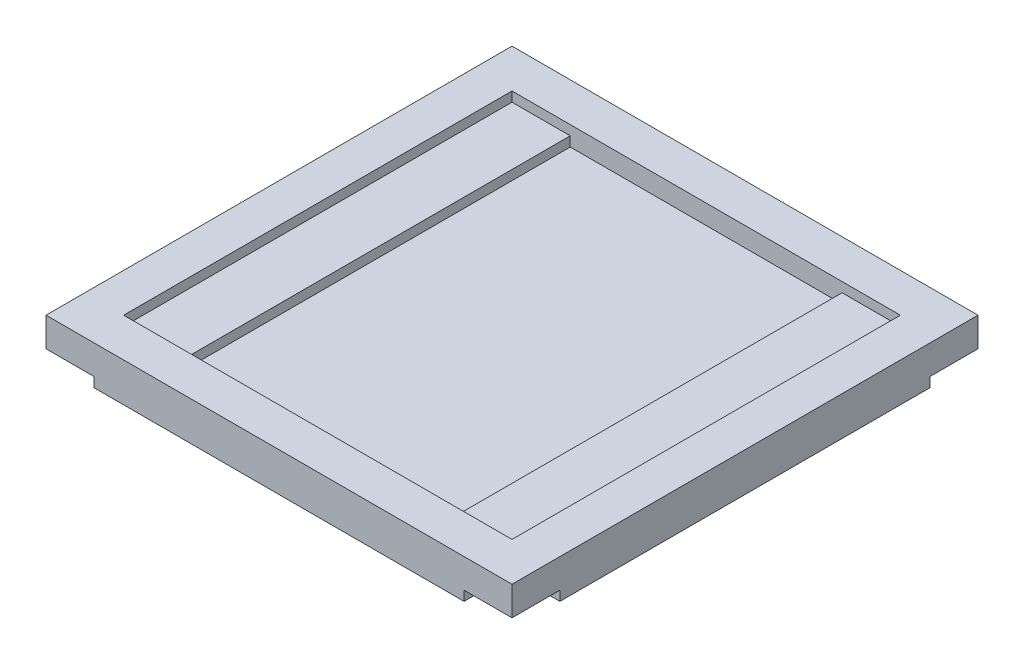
ISO-10303-21;
HEADER;
FILE_DESCRIPTION(('STEP AP214'),'2;1');
FILE_NAME('part.step','',(''),(''),'','','');
FILE_SCHEMA(('AUTOMOTIVE_DESIGN { 1 0 10303 214 1 1 1 1 }'));
ENDSEC;
DATA;
#1=APPLICATION_CONTEXT('core data for automotive mechanical design processes');
#2=APPLICATION_PROTOCOL_DEFINITION('international standard','automotive_design',2000,#1);
#3=PRODUCT_CONTEXT('',#1,'mechanical');
#4=PRODUCT('Part','Part','',(#3));
#5=PRODUCT_RELATED_PRODUCT_CATEGORY('part','',(#4));
#6=PRODUCT_DEFINITION_FORMATION('','',#4);
#7=PRODUCT_DEFINITION_CONTEXT('part definition',#1,'design');
#8=PRODUCT_DEFINITION('design','',#6,#7);
#9=PRODUCT_DEFINITION_SHAPE('','',#8);
#10=(LENGTH_UNIT() NAMED_UNIT(*) SI_UNIT(.MILLI.,.METRE.));
#11=(NAMED_UNIT(*) PLANE_ANGLE_UNIT() SI_UNIT($,.RADIAN.));
#12=(NAMED_UNIT(*) SI_UNIT($,.STERADIAN.) SOLID_ANGLE_UNIT());
#13=UNCERTAINTY_MEASURE_WITH_UNIT(LENGTH_MEASURE(1.E-05),#10,'distance_accuracy_value','');
#14=(GEOMETRIC_REPRESENTATION_CONTEXT(3) GLOBAL_UNCERTAINTY_ASSIGNED_CONTEXT((#13)) GLOBAL_UNIT_ASSIGNED_CONTEXT((#10,
#11,#12)) REPRESENTATION_CONTEXT('',''));
#15=CARTESIAN_POINT('',(0.,0.,0.));
#16=DIRECTION('',(0.,0.,1.));
#17=DIRECTION('',(1.,0.,0.));
#18=AXIS2_PLACEMENT_3D('',#15,#16,#17);
#19=CARTESIAN_POINT('',(0.,7.5,0.));
#20=DIRECTION('',(0.,1.,0.));
#21=DIRECTION('',(0.,0.,1.));
#22=AXIS2_PLACEMENT_3D('',#19,#20,#21);
#23=PLANE('',#22);
#24=DIRECTION('',(0.,0.,1.));
#25=VECTOR('',#24,1.);
#26=CARTESIAN_POINT('',(15.,7.5,-100.));
#27=LINE('',#26,#25);
#28=CARTESIAN_POINT('',(15.,7.5,-100.));
#29=VERTEX_POINT('',#28);
#30=CARTESIAN_POINT('',(15.,7.5,0.));
#31=VERTEX_POINT('',#30);
#32=EDGE_CURVE('E215',#29,#31,#27,.T.);
#33=ORIENTED_EDGE('',*,*,#32,.F.);
#34=DIRECTION('',(-1.,0.,0.));
#35=VECTOR('',#34,1.);
#36=CARTESIAN_POINT('',(0.,7.5,-100.));
#37=LINE('',#36,#35);
#38=CARTESIAN_POINT('',(0.,7.5,-100.));
#39=VERTEX_POINT('',#38);
#40=EDGE_CURVE('E267',#29,#39,#37,.T.);
#41=ORIENTED_EDGE('',*,*,#40,.T.);
#42=DIRECTION('',(0.,0.,1.));
#43=VECTOR('',#42,1.);
#44=CARTESIAN_POINT('',(0.,7.5,-100.));
#45=LINE('',#44,#43);
#46=CARTESIAN_POINT('',(0.,7.5,0.));
#47=VERTEX_POINT('',#46);
#48=EDGE_CURVE('E254',#39,#47,#45,.T.);
#49=ORIENTED_EDGE('',*,*,#48,.T.);
#50=DIRECTION('',(1.,0.,0.));
#51=VECTOR('',#50,1.);
#52=CARTESIAN_POINT('',(0.,7.5,0.));
#53=LINE('',#52,#51);
#54=EDGE_CURVE('E260',#47,#31,#53,.T.);
#55=ORIENTED_EDGE('',*,*,#54,.T.);
#56=EDGE_LOOP('',(#33,#41,#49,#55));
#57=FACE_BOUND('',#56,.T.);
#58=ADVANCED_FACE('F45',(#57),#23,.T.);
#59=CARTESIAN_POINT('',(-10.,10.,10.));
#60=DIRECTION('',(0.,0.,-1.));
#61=DIRECTION('',(-1.,0.,0.));
#62=AXIS2_PLACEMENT_3D('',#59,#60,#61);
#63=PLANE('',#62);
#64=DIRECTION('',(1.,0.,0.));
#65=VECTOR('',#64,1.);
#66=CARTESIAN_POINT('',(-10.,0.,10.));
#67=LINE('',#66,#65);
#68=CARTESIAN_POINT('',(2.34,0.,10.));
#69=VERTEX_POINT('',#68);
#70=CARTESIAN_POINT('',(97.66,0.,10.));
#71=VERTEX_POINT('',#70);
#72=EDGE_CURVE('E417',#69,#71,#67,.T.);
#73=ORIENTED_EDGE('',*,*,#72,.T.);
#74=DIRECTION('',(0.,-1.,0.));
#75=VECTOR('',#74,1.);
#76=CARTESIAN_POINT('',(97.66,2.5,10.));
#77=LINE('',#76,#75);
#78=CARTESIAN_POINT('',(97.66,2.5,10.));
#79=VERTEX_POINT('',#78);
#80=EDGE_CURVE('E306',#79,#71,#77,.T.);
#81=ORIENTED_EDGE('',*,*,#80,.F.);
#82=DIRECTION('',(-1.,0.,0.));
#83=VECTOR('',#82,1.);
#84=CARTESIAN_POINT('',(97.66,2.5,10.));
#85=LINE('',#84,#83);
#86=CARTESIAN_POINT('',(110.,2.5,10.));
#87=VERTEX_POINT('',#86);
#88=EDGE_CURVE('E301',#87,#79,#85,.T.);
#89=ORIENTED_EDGE('',*,*,#88,.F.);
#90=DIRECTION('',(0.,-1.,0.));
#91=VECTOR('',#90,1.);
#92=CARTESIAN_POINT('',(110.,10.,10.));
#93=LINE('',#92,#91);
#94=CARTESIAN_POINT('',(110.,10.,10.));
#95=VERTEX_POINT('',#94);
#96=EDGE_CURVE('E11',#95,#87,#93,.T.);
#97=ORIENTED_EDGE('',*,*,#96,.F.);
#98=DIRECTION('',(1.,0.,0.));
#99=VECTOR('',#98,1.);
#100=CARTESIAN_POINT('',(-10.,10.,10.));
#101=LINE('',#100,#99);
#102=CARTESIAN_POINT('',(-10.,10.,10.));
#103=VERTEX_POINT('',#102);
#104=EDGE_CURVE('E423',#103,#95,#101,.T.);
#105=ORIENTED_EDGE('',*,*,#104,.F.);
#106=DIRECTION('',(0.,-1.,0.));
#107=VECTOR('',#106,1.);
#108=CARTESIAN_POINT('',(-10.,10.,10.));
#109=LINE('',#108,#107);
#110=CARTESIAN_POINT('',(-10.,2.5,10.));
#111=VERTEX_POINT('',#110);
#112=EDGE_CURVE('E437',#103,#111,#109,.T.);
#113=ORIENTED_EDGE('',*,*,#112,.T.);
#114=DIRECTION('',(-1.,0.,0.));
#115=VECTOR('',#114,1.);
#116=CARTESIAN_POINT('',(-10.,2.5,10.));
#117=LINE('',#116,#115);
#118=CARTESIAN_POINT('',(2.34,2.5,10.));
#119=VERTEX_POINT('',#118);
#120=EDGE_CURVE('E404',#119,#111,#117,.T.);
#121=ORIENTED_EDGE('',*,*,#120,.F.);
#122=DIRECTION('',(0.,-1.,0.));
#123=VECTOR('',#122,1.);
#124=CARTESIAN_POINT('',(2.34,2.5,10.));
#125=LINE('',#124,#123);
#126=EDGE_CURVE('E413',#119,#69,#125,.T.);
#127=ORIENTED_EDGE('',*,*,#126,.T.);
#128=EDGE_LOOP('',(#73,#81,#89,#97,#105,#113,#121,#127));
#129=FACE_BOUND('',#128,.T.);
#130=ADVANCED_FACE('F47',(#129),#63,.F.);
#131=CARTESIAN_POINT('',(110.,10.,10.));
#132=DIRECTION('',(-1.,0.,0.));
#133=DIRECTION('',(0.,0.,1.));
#134=AXIS2_PLACEMENT_3D('',#131,#132,#133);
#135=PLANE('',#134);
#136=DIRECTION('',(0.,0.,-1.));
#137=VECTOR('',#136,1.);
#138=CARTESIAN_POINT('',(110.,0.,10.));
#139=LINE('',#138,#137);
#140=CARTESIAN_POINT('',(110.,0.,-2.34));
#141=VERTEX_POINT('',#140);
#142=CARTESIAN_POINT('',(110.,0.,-97.66));
#143=VERTEX_POINT('',#142);
#144=EDGE_CURVE('E441',#141,#143,#139,.T.);
#145=ORIENTED_EDGE('',*,*,#144,.T.);
#146=DIRECTION('',(0.,-1.,0.));
#147=VECTOR('',#146,1.);
#148=CARTESIAN_POINT('',(110.,2.5,-97.66));
#149=LINE('',#148,#147);
#150=CARTESIAN_POINT('',(110.,2.5,-97.66));
#151=VERTEX_POINT('',#150);
#152=EDGE_CURVE('E336',#151,#143,#149,.T.);
#153=ORIENTED_EDGE('',*,*,#152,.F.);
#154=DIRECTION('',(0.,0.,1.));
#155=VECTOR('',#154,1.);
#156=CARTESIAN_POINT('',(110.,2.5,-97.66));
#157=LINE('',#156,#155);
#158=CARTESIAN_POINT('',(110.,2.5,-110.));
#159=VERTEX_POINT('',#158);
#160=EDGE_CURVE('E353',#159,#151,#157,.T.);
#161=ORIENTED_EDGE('',*,*,#160,.F.);
#162=DIRECTION('',(0.,-1.,0.));
#163=VECTOR('',#162,1.);
#164=CARTESIAN_POINT('',(110.,10.,-110.));
#165=LINE('',#164,#163);
#166=CARTESIAN_POINT('',(110.,10.,-110.));
#167=VERTEX_POINT('',#166);
#168=EDGE_CURVE('E54',#167,#159,#165,.T.);
#169=ORIENTED_EDGE('',*,*,#168,.F.);
#170=DIRECTION('',(0.,0.,-1.));
#171=VECTOR('',#170,1.);
#172=CARTESIAN_POINT('',(110.,10.,10.));
#173=LINE('',#172,#171);
#174=EDGE_CURVE('E427',#95,#167,#173,.T.);
#175=ORIENTED_EDGE('',*,*,#174,.F.);
#176=ORIENTED_EDGE('',*,*,#96,.T.);
#177=DIRECTION('',(0.,0.,1.));
#178=VECTOR('',#177,1.);
#179=CARTESIAN_POINT('',(110.,2.5,10.));
#180=LINE('',#179,#178);
#181=CARTESIAN_POINT('',(110.,2.5,-2.34));
#182=VERTEX_POINT('',#181);
#183=EDGE_CURVE('E321',#182,#87,#180,.T.);
#184=ORIENTED_EDGE('',*,*,#183,.F.);
#185=DIRECTION('',(0.,-1.,0.));
#186=VECTOR('',#185,1.);
#187=CARTESIAN_POINT('',(110.,2.5,-2.34));
#188=LINE('',#187,#186);
#189=EDGE_CURVE('E302',#182,#141,#188,.T.);
#190=ORIENTED_EDGE('',*,*,#189,.T.);
#191=EDGE_LOOP('',(#145,#153,#161,#169,#175,#176,#184,#190));
#192=FACE_BOUND('',#191,.T.);
#193=ADVANCED_FACE('F468',(#192),#135,.F.);
#194=CARTESIAN_POINT('',(-10.,10.,-110.));
#195=DIRECTION('',(0.,0.,1.));
#196=DIRECTION('',(1.,0.,0.));
#197=AXIS2_PLACEMENT_3D('',#194,#195,#196);
#198=PLANE('',#197);
#199=DIRECTION('',(-1.,0.,0.));
#200=VECTOR('',#199,1.);
#201=CARTESIAN_POINT('',(-10.,0.,-110.));
#202=LINE('',#201,#200);
#203=CARTESIAN_POINT('',(97.66,0.,-110.));
#204=VERTEX_POINT('',#203);
#205=CARTESIAN_POINT('',(2.33999999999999,0.,-110.));
#206=VERTEX_POINT('',#205);
#207=EDGE_CURVE('E445',#204,#206,#202,.T.);
#208=ORIENTED_EDGE('',*,*,#207,.T.);
#209=DIRECTION('',(0.,-1.,0.));
#210=VECTOR('',#209,1.);
#211=CARTESIAN_POINT('',(2.33999999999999,2.5,-110.));
#212=LINE('',#211,#210);
#213=CARTESIAN_POINT('',(2.33999999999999,2.5,-110.));
#214=VERTEX_POINT('',#213);
#215=EDGE_CURVE('E367',#214,#206,#212,.T.);
#216=ORIENTED_EDGE('',*,*,#215,.F.);
#217=DIRECTION('',(1.,0.,0.));
#218=VECTOR('',#217,1.);
#219=CARTESIAN_POINT('',(-9.99999999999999,2.5,-110.));
#220=LINE('',#219,#218);
#221=CARTESIAN_POINT('',(-9.99999999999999,2.5,-110.));
#222=VERTEX_POINT('',#221);
#223=EDGE_CURVE('E382',#222,#214,#220,.T.);
#224=ORIENTED_EDGE('',*,*,#223,.F.);
#225=DIRECTION('',(0.,-1.,0.));
#226=VECTOR('',#225,1.);
#227=CARTESIAN_POINT('',(-10.,10.,-110.));
#228=LINE('',#227,#226);
#229=CARTESIAN_POINT('',(-10.,10.,-110.));
#230=VERTEX_POINT('',#229);
#231=EDGE_CURVE('E455',#230,#222,#228,.T.);
#232=ORIENTED_EDGE('',*,*,#231,.F.);
#233=DIRECTION('',(-1.,0.,0.));
#234=VECTOR('',#233,1.);
#235=CARTESIAN_POINT('',(-10.,10.,-110.));
#236=LINE('',#235,#234);
#237=EDGE_CURVE('E431',#167,#230,#236,.T.);
#238=ORIENTED_EDGE('',*,*,#237,.F.);
#239=ORIENTED_EDGE('',*,*,#168,.T.);
#240=DIRECTION('',(1.,0.,0.));
#241=VECTOR('',#240,1.);
#242=CARTESIAN_POINT('',(97.66,2.5,-110.));
#243=LINE('',#242,#241);
#244=CARTESIAN_POINT('',(97.66,2.5,-110.));
#245=VERTEX_POINT('',#244);
#246=EDGE_CURVE('E356',#245,#159,#243,.T.);
#247=ORIENTED_EDGE('',*,*,#246,.F.);
#248=DIRECTION('',(0.,-1.,0.));
#249=VECTOR('',#248,1.);
#250=CARTESIAN_POINT('',(97.66,2.5,-110.));
#251=LINE('',#250,#249);
#252=EDGE_CURVE('E331',#245,#204,#251,.T.);
#253=ORIENTED_EDGE('',*,*,#252,.T.);
#254=EDGE_LOOP('',(#208,#216,#224,#232,#238,#239,#247,#253));
#255=FACE_BOUND('',#254,.T.);
#256=ADVANCED_FACE('F464',(#255),#198,.F.);
#257=CARTESIAN_POINT('',(-10.,10.,10.));
#258=DIRECTION('',(1.,0.,0.));
#259=DIRECTION('',(0.,0.,-1.));
#260=AXIS2_PLACEMENT_3D('',#257,#258,#259);
#261=PLANE('',#260);
#262=DIRECTION('',(0.,0.,-1.));
#263=VECTOR('',#262,1.);
#264=CARTESIAN_POINT('',(-9.99999999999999,2.5,-97.66));
#265=LINE('',#264,#263);
#266=CARTESIAN_POINT('',(-9.99999999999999,2.5,-97.66));
#267=VERTEX_POINT('',#266);
#268=EDGE_CURVE('E385',#267,#222,#265,.T.);
#269=ORIENTED_EDGE('',*,*,#268,.F.);
#270=DIRECTION('',(0.,-1.,0.));
#271=VECTOR('',#270,1.);
#272=CARTESIAN_POINT('',(-9.99999999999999,2.5,-97.66));
#273=LINE('',#272,#271);
#274=CARTESIAN_POINT('',(-9.99999999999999,0.,-97.66));
#275=VERTEX_POINT('',#274);
#276=EDGE_CURVE('E362',#267,#275,#273,.T.);
#277=ORIENTED_EDGE('',*,*,#276,.T.);
#278=DIRECTION('',(0.,0.,1.));
#279=VECTOR('',#278,1.);
#280=CARTESIAN_POINT('',(-10.,0.,10.));
#281=LINE('',#280,#279);
#282=CARTESIAN_POINT('',(-10.,0.,-2.34));
#283=VERTEX_POINT('',#282);
#284=EDGE_CURVE('E428',#275,#283,#281,.T.);
#285=ORIENTED_EDGE('',*,*,#284,.T.);
#286=DIRECTION('',(0.,-1.,0.));
#287=VECTOR('',#286,1.);
#288=CARTESIAN_POINT('',(-10.,2.5,-2.34));
#289=LINE('',#288,#287);
#290=CARTESIAN_POINT('',(-10.,2.5,-2.34));
#291=VERTEX_POINT('',#290);
#292=EDGE_CURVE('E407',#291,#283,#289,.T.);
#293=ORIENTED_EDGE('',*,*,#292,.F.);
#294=DIRECTION('',(0.,0.,-1.));
#295=VECTOR('',#294,1.);
#296=CARTESIAN_POINT('',(-10.,2.5,10.));
#297=LINE('',#296,#295);
#298=EDGE_CURVE('E391',#111,#291,#297,.T.);
#299=ORIENTED_EDGE('',*,*,#298,.F.);
#300=ORIENTED_EDGE('',*,*,#112,.F.);
#301=DIRECTION('',(0.,0.,1.));
#302=VECTOR('',#301,1.);
#303=CARTESIAN_POINT('',(-10.,10.,10.));
#304=LINE('',#303,#302);
#305=EDGE_CURVE('E434',#230,#103,#304,.T.);
#306=ORIENTED_EDGE('',*,*,#305,.F.);
#307=ORIENTED_EDGE('',*,*,#231,.T.);
#308=EDGE_LOOP('',(#269,#277,#285,#293,#299,#300,#306,#307));
#309=FACE_BOUND('',#308,.T.);
#310=ADVANCED_FACE('F496',(#309),#261,.F.);
#311=CARTESIAN_POINT('',(0.,10.,0.));
#312=DIRECTION('',(0.,1.,0.));
#313=DIRECTION('',(0.,0.,1.));
#314=AXIS2_PLACEMENT_3D('',#311,#312,#313);
#315=PLANE('',#314);
#316=DIRECTION('',(0.,0.,1.));
#317=VECTOR('',#316,1.);
#318=CARTESIAN_POINT('',(0.,10.,-100.));
#319=LINE('',#318,#317);
#320=CARTESIAN_POINT('',(0.,10.,-100.));
#321=VERTEX_POINT('',#320);
#322=CARTESIAN_POINT('',(0.,10.,0.));
#323=VERTEX_POINT('',#322);
#324=EDGE_CURVE('E69',#321,#323,#319,.T.);
#325=ORIENTED_EDGE('',*,*,#324,.F.);
#326=DIRECTION('',(-1.,0.,0.));
#327=VECTOR('',#326,1.);
#328=CARTESIAN_POINT('',(0.,10.,-100.));
#329=LINE('',#328,#327);
#330=CARTESIAN_POINT('',(100.,10.,-100.));
#331=VERTEX_POINT('',#330);
#332=EDGE_CURVE('E259',#331,#321,#329,.T.);
#333=ORIENTED_EDGE('',*,*,#332,.F.);
#334=DIRECTION('',(0.,0.,-1.));
#335=VECTOR('',#334,1.);
#336=CARTESIAN_POINT('',(100.,10.,-100.));
#337=LINE('',#336,#335);
#338=CARTESIAN_POINT('',(100.,10.,0.));
#339=VERTEX_POINT('',#338);
#340=EDGE_CURVE('E278',#339,#331,#337,.T.);
#341=ORIENTED_EDGE('',*,*,#340,.F.);
#342=DIRECTION('',(1.,0.,0.));
#343=VECTOR('',#342,1.);
#344=CARTESIAN_POINT('',(0.,10.,0.));
#345=LINE('',#344,#343);
#346=EDGE_CURVE('E275',#323,#339,#345,.T.);
#347=ORIENTED_EDGE('',*,*,#346,.F.);
#348=EDGE_LOOP('',(#325,#333,#341,#347));
#349=FACE_BOUND('',#348,.T.);
#350=ORIENTED_EDGE('',*,*,#104,.T.);
#351=ORIENTED_EDGE('',*,*,#174,.T.);
#352=ORIENTED_EDGE('',*,*,#237,.T.);
#353=ORIENTED_EDGE('',*,*,#305,.T.);
#354=EDGE_LOOP('',(#350,#351,#352,#353));
#355=FACE_BOUND('',#354,.T.);
#356=ADVANCED_FACE('F501',(#349,#355),#315,.T.);
#357=CARTESIAN_POINT('',(0.,0.,0.));
#358=DIRECTION('',(0.,1.,0.));
#359=DIRECTION('',(0.,0.,1.));
#360=AXIS2_PLACEMENT_3D('',#357,#358,#359);
#361=PLANE('',#360);
#362=ORIENTED_EDGE('',*,*,#284,.F.);
#363=DIRECTION('',(-1.,0.,0.));
#364=VECTOR('',#363,1.);
#365=CARTESIAN_POINT('',(-9.99999999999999,0.,-97.66));
#366=LINE('',#365,#364);
#367=CARTESIAN_POINT('',(2.33999999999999,0.,-97.66));
#368=VERTEX_POINT('',#367);
#369=EDGE_CURVE('E342',#368,#275,#366,.T.);
#370=ORIENTED_EDGE('',*,*,#369,.F.);
#371=DIRECTION('',(0.,0.,1.));
#372=VECTOR('',#371,1.);
#373=CARTESIAN_POINT('',(2.33999999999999,0.,-97.66));
#374=LINE('',#373,#372);
#375=EDGE_CURVE('E372',#206,#368,#374,.T.);
#376=ORIENTED_EDGE('',*,*,#375,.F.);
#377=ORIENTED_EDGE('',*,*,#207,.F.);
#378=DIRECTION('',(0.,0.,-1.));
#379=VECTOR('',#378,1.);
#380=CARTESIAN_POINT('',(97.66,0.,-97.66));
#381=LINE('',#380,#379);
#382=CARTESIAN_POINT('',(97.66,0.,-97.66));
#383=VERTEX_POINT('',#382);
#384=EDGE_CURVE('E309',#383,#204,#381,.T.);
#385=ORIENTED_EDGE('',*,*,#384,.F.);
#386=DIRECTION('',(-1.,0.,0.));
#387=VECTOR('',#386,1.);
#388=CARTESIAN_POINT('',(97.66,0.,-97.66));
#389=LINE('',#388,#387);
#390=EDGE_CURVE('E343',#143,#383,#389,.T.);
#391=ORIENTED_EDGE('',*,*,#390,.F.);
#392=ORIENTED_EDGE('',*,*,#144,.F.);
#393=DIRECTION('',(1.,0.,0.));
#394=VECTOR('',#393,1.);
#395=CARTESIAN_POINT('',(97.66,0.,-2.34));
#396=LINE('',#395,#394);
#397=CARTESIAN_POINT('',(97.66,0.,-2.34));
#398=VERTEX_POINT('',#397);
#399=EDGE_CURVE('E310',#398,#141,#396,.T.);
#400=ORIENTED_EDGE('',*,*,#399,.F.);
#401=DIRECTION('',(0.,0.,-1.));
#402=VECTOR('',#401,1.);
#403=CARTESIAN_POINT('',(97.66,0.,10.));
#404=LINE('',#403,#402);
#405=EDGE_CURVE('E313',#71,#398,#404,.T.);
#406=ORIENTED_EDGE('',*,*,#405,.F.);
#407=ORIENTED_EDGE('',*,*,#72,.F.);
#408=DIRECTION('',(0.,0.,1.));
#409=VECTOR('',#408,1.);
#410=CARTESIAN_POINT('',(2.34,0.,10.));
#411=LINE('',#410,#409);
#412=CARTESIAN_POINT('',(2.34,0.,-2.34));
#413=VERTEX_POINT('',#412);
#414=EDGE_CURVE('E396',#413,#69,#411,.T.);
#415=ORIENTED_EDGE('',*,*,#414,.F.);
#416=DIRECTION('',(1.,0.,0.));
#417=VECTOR('',#416,1.);
#418=CARTESIAN_POINT('',(-10.,0.,-2.34));
#419=LINE('',#418,#417);
#420=EDGE_CURVE('E317',#283,#413,#419,.T.);
#421=ORIENTED_EDGE('',*,*,#420,.F.);
#422=EDGE_LOOP('',(#362,#370,#376,#377,#385,#391,#392,#400,#406,#407,#415,#421));
#423=FACE_BOUND('',#422,.T.);
#424=ADVANCED_FACE('F485',(#423),#361,.F.);
#425=CARTESIAN_POINT('',(2.34,2.5,10.));
#426=DIRECTION('',(1.,0.,0.));
#427=DIRECTION('',(0.,0.,-1.));
#428=AXIS2_PLACEMENT_3D('',#425,#426,#427);
#429=PLANE('',#428);
#430=ORIENTED_EDGE('',*,*,#414,.T.);
#431=ORIENTED_EDGE('',*,*,#126,.F.);
#432=DIRECTION('',(0.,0.,1.));
#433=VECTOR('',#432,1.);
#434=CARTESIAN_POINT('',(2.34,2.5,10.));
#435=LINE('',#434,#433);
#436=CARTESIAN_POINT('',(2.34,2.5,-2.34));
#437=VERTEX_POINT('',#436);
#438=EDGE_CURVE('E400',#437,#119,#435,.T.);
#439=ORIENTED_EDGE('',*,*,#438,.F.);
#440=DIRECTION('',(0.,-1.,0.));
#441=VECTOR('',#440,1.);
#442=CARTESIAN_POINT('',(2.34,2.5,-2.34));
#443=LINE('',#442,#441);
#444=EDGE_CURVE('E418',#437,#413,#443,.T.);
#445=ORIENTED_EDGE('',*,*,#444,.T.);
#446=EDGE_LOOP('',(#430,#431,#439,#445));
#447=FACE_BOUND('',#446,.T.);
#448=ADVANCED_FACE('F521',(#447),#429,.F.);
#449=CARTESIAN_POINT('',(-10.,2.5,-2.34));
#450=DIRECTION('',(0.,0.,-1.));
#451=DIRECTION('',(-1.,0.,0.));
#452=AXIS2_PLACEMENT_3D('',#449,#450,#451);
#453=PLANE('',#452);
#454=ORIENTED_EDGE('',*,*,#420,.T.);
#455=ORIENTED_EDGE('',*,*,#444,.F.);
#456=DIRECTION('',(1.,0.,0.));
#457=VECTOR('',#456,1.);
#458=CARTESIAN_POINT('',(-10.,2.5,-2.34));
#459=LINE('',#458,#457);
#460=EDGE_CURVE('E395',#291,#437,#459,.T.);
#461=ORIENTED_EDGE('',*,*,#460,.F.);
#462=ORIENTED_EDGE('',*,*,#292,.T.);
#463=EDGE_LOOP('',(#454,#455,#461,#462));
#464=FACE_BOUND('',#463,.T.);
#465=ADVANCED_FACE('F526',(#464),#453,.F.);
#466=CARTESIAN_POINT('',(0.,2.5,0.));
#467=DIRECTION('',(0.,-1.,0.));
#468=DIRECTION('',(0.,0.,-1.));
#469=AXIS2_PLACEMENT_3D('',#466,#467,#468);
#470=PLANE('',#469);
#471=ORIENTED_EDGE('',*,*,#298,.T.);
#472=ORIENTED_EDGE('',*,*,#460,.T.);
#473=ORIENTED_EDGE('',*,*,#438,.T.);
#474=ORIENTED_EDGE('',*,*,#120,.T.);
#475=EDGE_LOOP('',(#471,#472,#473,#474));
#476=FACE_BOUND('',#475,.T.);
#477=ADVANCED_FACE('F523',(#476),#470,.T.);
#478=CARTESIAN_POINT('',(97.66,2.5,10.));
#479=DIRECTION('',(-1.,0.,0.));
#480=DIRECTION('',(0.,0.,1.));
#481=AXIS2_PLACEMENT_3D('',#478,#479,#480);
#482=PLANE('',#481);
#483=ORIENTED_EDGE('',*,*,#405,.T.);
#484=DIRECTION('',(0.,-1.,0.));
#485=VECTOR('',#484,1.);
#486=CARTESIAN_POINT('',(97.66,2.5,-2.34));
#487=LINE('',#486,#485);
#488=CARTESIAN_POINT('',(97.66,2.5,-2.34));
#489=VERTEX_POINT('',#488);
#490=EDGE_CURVE('E297',#489,#398,#487,.T.);
#491=ORIENTED_EDGE('',*,*,#490,.F.);
#492=DIRECTION('',(0.,0.,-1.));
#493=VECTOR('',#492,1.);
#494=CARTESIAN_POINT('',(97.66,2.5,10.));
#495=LINE('',#494,#493);
#496=EDGE_CURVE('E314',#79,#489,#495,.T.);
#497=ORIENTED_EDGE('',*,*,#496,.F.);
#498=ORIENTED_EDGE('',*,*,#80,.T.);
#499=EDGE_LOOP('',(#483,#491,#497,#498));
#500=FACE_BOUND('',#499,.T.);
#501=ADVANCED_FACE('F685',(#500),#482,.F.);
#502=CARTESIAN_POINT('',(97.66,2.5,-2.34));
#503=DIRECTION('',(0.,0.,-1.));
#504=DIRECTION('',(-1.,0.,0.));
#505=AXIS2_PLACEMENT_3D('',#502,#503,#504);
#506=PLANE('',#505);
#507=ORIENTED_EDGE('',*,*,#399,.T.);
#508=ORIENTED_EDGE('',*,*,#189,.F.);
#509=DIRECTION('',(1.,0.,0.));
#510=VECTOR('',#509,1.);
#511=CARTESIAN_POINT('',(97.66,2.5,-2.34));
#512=LINE('',#511,#510);
#513=EDGE_CURVE('E324',#489,#182,#512,.T.);
#514=ORIENTED_EDGE('',*,*,#513,.F.);
#515=ORIENTED_EDGE('',*,*,#490,.T.);
#516=EDGE_LOOP('',(#507,#508,#514,#515));
#517=FACE_BOUND('',#516,.T.);
#518=ADVANCED_FACE('F512',(#517),#506,.F.);
#519=CARTESIAN_POINT('',(0.,2.5,0.));
#520=DIRECTION('',(0.,-1.,0.));
#521=DIRECTION('',(0.,0.,-1.));
#522=AXIS2_PLACEMENT_3D('',#519,#520,#521);
#523=PLANE('',#522);
#524=ORIENTED_EDGE('',*,*,#496,.T.);
#525=ORIENTED_EDGE('',*,*,#513,.T.);
#526=ORIENTED_EDGE('',*,*,#183,.T.);
#527=ORIENTED_EDGE('',*,*,#88,.T.);
#528=EDGE_LOOP('',(#524,#525,#526,#527));
#529=FACE_BOUND('',#528,.T.);
#530=ADVANCED_FACE('F509',(#529),#523,.T.);
#531=CARTESIAN_POINT('',(97.66,2.5,-97.66));
#532=DIRECTION('',(-1.,0.,0.));
#533=DIRECTION('',(0.,0.,1.));
#534=AXIS2_PLACEMENT_3D('',#531,#532,#533);
#535=PLANE('',#534);
#536=ORIENTED_EDGE('',*,*,#384,.T.);
#537=ORIENTED_EDGE('',*,*,#252,.F.);
#538=DIRECTION('',(0.,0.,-1.));
#539=VECTOR('',#538,1.);
#540=CARTESIAN_POINT('',(97.66,2.5,-97.66));
#541=LINE('',#540,#539);
#542=CARTESIAN_POINT('',(97.66,2.5,-97.66));
#543=VERTEX_POINT('',#542);
#544=EDGE_CURVE('E347',#543,#245,#541,.T.);
#545=ORIENTED_EDGE('',*,*,#544,.F.);
#546=DIRECTION('',(0.,-1.,0.));
#547=VECTOR('',#546,1.);
#548=CARTESIAN_POINT('',(97.66,2.5,-97.66));
#549=LINE('',#548,#547);
#550=EDGE_CURVE('E339',#543,#383,#549,.T.);
#551=ORIENTED_EDGE('',*,*,#550,.T.);
#552=EDGE_LOOP('',(#536,#537,#545,#551));
#553=FACE_BOUND('',#552,.T.);
#554=ADVANCED_FACE('F479',(#553),#535,.F.);
#555=CARTESIAN_POINT('',(97.66,2.5,-97.66));
#556=DIRECTION('',(0.,0.,1.));
#557=DIRECTION('',(1.,0.,0.));
#558=AXIS2_PLACEMENT_3D('',#555,#556,#557);
#559=PLANE('',#558);
#560=ORIENTED_EDGE('',*,*,#390,.T.);
#561=ORIENTED_EDGE('',*,*,#550,.F.);
#562=DIRECTION('',(-1.,0.,0.));
#563=VECTOR('',#562,1.);
#564=CARTESIAN_POINT('',(97.66,2.5,-97.66));
#565=LINE('',#564,#563);
#566=EDGE_CURVE('E335',#151,#543,#565,.T.);
#567=ORIENTED_EDGE('',*,*,#566,.F.);
#568=ORIENTED_EDGE('',*,*,#152,.T.);
#569=EDGE_LOOP('',(#560,#561,#567,#568));
#570=FACE_BOUND('',#569,.T.);
#571=ADVANCED_FACE('F474',(#570),#559,.F.);
#572=CARTESIAN_POINT('',(0.,2.5,0.));
#573=DIRECTION('',(0.,-1.,0.));
#574=DIRECTION('',(0.,0.,-1.));
#575=AXIS2_PLACEMENT_3D('',#572,#573,#574);
#576=PLANE('',#575);
#577=ORIENTED_EDGE('',*,*,#544,.T.);
#578=ORIENTED_EDGE('',*,*,#246,.T.);
#579=ORIENTED_EDGE('',*,*,#160,.T.);
#580=ORIENTED_EDGE('',*,*,#566,.T.);
#581=EDGE_LOOP('',(#577,#578,#579,#580));
#582=FACE_BOUND('',#581,.T.);
#583=ADVANCED_FACE('F472',(#582),#576,.T.);
#584=CARTESIAN_POINT('',(-9.99999999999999,2.5,-97.66));
#585=DIRECTION('',(0.,0.,1.));
#586=DIRECTION('',(1.,0.,0.));
#587=AXIS2_PLACEMENT_3D('',#584,#585,#586);
#588=PLANE('',#587);
#589=ORIENTED_EDGE('',*,*,#369,.T.);
#590=ORIENTED_EDGE('',*,*,#276,.F.);
#591=DIRECTION('',(-1.,0.,0.));
#592=VECTOR('',#591,1.);
#593=CARTESIAN_POINT('',(-9.99999999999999,2.5,-97.66));
#594=LINE('',#593,#592);
#595=CARTESIAN_POINT('',(2.33999999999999,2.5,-97.66));
#596=VERTEX_POINT('',#595);
#597=EDGE_CURVE('E376',#596,#267,#594,.T.);
#598=ORIENTED_EDGE('',*,*,#597,.F.);
#599=DIRECTION('',(0.,-1.,0.));
#600=VECTOR('',#599,1.);
#601=CARTESIAN_POINT('',(2.33999999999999,2.5,-97.66));
#602=LINE('',#601,#600);
#603=EDGE_CURVE('E288',#596,#368,#602,.T.);
#604=ORIENTED_EDGE('',*,*,#603,.T.);
#605=EDGE_LOOP('',(#589,#590,#598,#604));
#606=FACE_BOUND('',#605,.T.);
#607=ADVANCED_FACE('F529',(#606),#588,.F.);
#608=CARTESIAN_POINT('',(2.33999999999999,2.5,-97.66));
#609=DIRECTION('',(1.,0.,0.));
#610=DIRECTION('',(0.,0.,-1.));
#611=AXIS2_PLACEMENT_3D('',#608,#609,#610);
#612=PLANE('',#611);
#613=ORIENTED_EDGE('',*,*,#375,.T.);
#614=ORIENTED_EDGE('',*,*,#603,.F.);
#615=DIRECTION('',(0.,0.,1.));
#616=VECTOR('',#615,1.);
#617=CARTESIAN_POINT('',(2.33999999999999,2.5,-97.66));
#618=LINE('',#617,#616);
#619=EDGE_CURVE('E366',#214,#596,#618,.T.);
#620=ORIENTED_EDGE('',*,*,#619,.F.);
#621=ORIENTED_EDGE('',*,*,#215,.T.);
#622=EDGE_LOOP('',(#613,#614,#620,#621));
#623=FACE_BOUND('',#622,.T.);
#624=ADVANCED_FACE('F488',(#623),#612,.F.);
#625=CARTESIAN_POINT('',(0.,2.5,0.));
#626=DIRECTION('',(0.,1.,0.));
#627=DIRECTION('',(0.,0.,1.));
#628=AXIS2_PLACEMENT_3D('',#625,#626,#627);
#629=PLANE('',#628);
#630=ORIENTED_EDGE('',*,*,#597,.T.);
#631=ORIENTED_EDGE('',*,*,#268,.T.);
#632=ORIENTED_EDGE('',*,*,#223,.T.);
#633=ORIENTED_EDGE('',*,*,#619,.T.);
#634=EDGE_LOOP('',(#630,#631,#632,#633));
#635=FACE_BOUND('',#634,.T.);
#636=ADVANCED_FACE('F530',(#635),#629,.F.);
#637=CARTESIAN_POINT('',(0.,7.5,-100.));
#638=DIRECTION('',(-1.,0.,0.));
#639=DIRECTION('',(0.,0.,1.));
#640=AXIS2_PLACEMENT_3D('',#637,#638,#639);
#641=PLANE('',#640);
#642=ORIENTED_EDGE('',*,*,#324,.T.);
#643=DIRECTION('',(0.,1.,0.));
#644=VECTOR('',#643,1.);
#645=CARTESIAN_POINT('',(0.,7.5,0.));
#646=LINE('',#645,#644);
#647=EDGE_CURVE('E272',#47,#323,#646,.T.);
#648=ORIENTED_EDGE('',*,*,#647,.F.);
#649=ORIENTED_EDGE('',*,*,#48,.F.);
#650=DIRECTION('',(0.,1.,0.));
#651=VECTOR('',#650,1.);
#652=CARTESIAN_POINT('',(0.,7.5,-100.));
#653=LINE('',#652,#651);
#654=EDGE_CURVE('E285',#39,#321,#653,.T.);
#655=ORIENTED_EDGE('',*,*,#654,.T.);
#656=EDGE_LOOP('',(#642,#648,#649,#655));
#657=FACE_BOUND('',#656,.T.);
#658=ADVANCED_FACE('F532',(#657),#641,.F.);
#659=CARTESIAN_POINT('',(0.,7.5,-100.));
#660=DIRECTION('',(0.,0.,-1.));
#661=DIRECTION('',(-1.,0.,0.));
#662=AXIS2_PLACEMENT_3D('',#659,#660,#661);
#663=PLANE('',#662);
#664=ORIENTED_EDGE('',*,*,#332,.T.);
#665=ORIENTED_EDGE('',*,*,#654,.F.);
#666=ORIENTED_EDGE('',*,*,#40,.F.);
#667=DIRECTION('',(0.,1.,0.));
#668=VECTOR('',#667,1.);
#669=CARTESIAN_POINT('',(15.,5.,-100.));
#670=LINE('',#669,#668);
#671=CARTESIAN_POINT('',(15.,5.,-100.));
#672=VERTEX_POINT('',#671);
#673=EDGE_CURVE('E246',#672,#29,#670,.T.);
#674=ORIENTED_EDGE('',*,*,#673,.F.);
#675=DIRECTION('',(-1.,0.,0.));
#676=VECTOR('',#675,1.);
#677=CARTESIAN_POINT('',(15.,5.,-100.));
#678=LINE('',#677,#676);
#679=CARTESIAN_POINT('',(85.,5.,-100.));
#680=VERTEX_POINT('',#679);
#681=EDGE_CURVE('E220',#680,#672,#678,.T.);
#682=ORIENTED_EDGE('',*,*,#681,.F.);
#683=DIRECTION('',(0.,1.,0.));
#684=VECTOR('',#683,1.);
#685=CARTESIAN_POINT('',(85.,5.,-100.));
#686=LINE('',#685,#684);
#687=CARTESIAN_POINT('',(85.,7.5,-100.));
#688=VERTEX_POINT('',#687);
#689=EDGE_CURVE('E249',#680,#688,#686,.T.);
#690=ORIENTED_EDGE('',*,*,#689,.T.);
#691=CARTESIAN_POINT('',(100.,7.5,-100.));
#692=VERTEX_POINT('',#691);
#693=EDGE_CURVE('E268',#692,#688,#37,.T.);
#694=ORIENTED_EDGE('',*,*,#693,.F.);
#695=DIRECTION('',(0.,1.,0.));
#696=VECTOR('',#695,1.);
#697=CARTESIAN_POINT('',(100.,7.5,-100.));
#698=LINE('',#697,#696);
#699=EDGE_CURVE('E289',#692,#331,#698,.T.);
#700=ORIENTED_EDGE('',*,*,#699,.T.);
#701=EDGE_LOOP('',(#664,#665,#666,#674,#682,#690,#694,#700));
#702=FACE_BOUND('',#701,.T.);
#703=ADVANCED_FACE('F539',(#702),#663,.F.);
#704=CARTESIAN_POINT('',(100.,7.5,-100.));
#705=DIRECTION('',(1.,0.,0.));
#706=DIRECTION('',(0.,0.,-1.));
#707=AXIS2_PLACEMENT_3D('',#704,#705,#706);
#708=PLANE('',#707);
#709=ORIENTED_EDGE('',*,*,#340,.T.);
#710=ORIENTED_EDGE('',*,*,#699,.F.);
#711=DIRECTION('',(0.,0.,-1.));
#712=VECTOR('',#711,1.);
#713=CARTESIAN_POINT('',(100.,7.5,-100.));
#714=LINE('',#713,#712);
#715=CARTESIAN_POINT('',(100.,7.5,0.));
#716=VERTEX_POINT('',#715);
#717=EDGE_CURVE('E263',#716,#692,#714,.T.);
#718=ORIENTED_EDGE('',*,*,#717,.F.);
#719=DIRECTION('',(0.,1.,0.));
#720=VECTOR('',#719,1.);
#721=CARTESIAN_POINT('',(100.,7.5,0.));
#722=LINE('',#721,#720);
#723=EDGE_CURVE('E292',#716,#339,#722,.T.);
#724=ORIENTED_EDGE('',*,*,#723,.T.);
#725=EDGE_LOOP('',(#709,#710,#718,#724));
#726=FACE_BOUND('',#725,.T.);
#727=ADVANCED_FACE('F561',(#726),#708,.F.);
#728=CARTESIAN_POINT('',(0.,7.5,0.));
#729=DIRECTION('',(0.,0.,1.));
#730=DIRECTION('',(1.,0.,0.));
#731=AXIS2_PLACEMENT_3D('',#728,#729,#730);
#732=PLANE('',#731);
#733=ORIENTED_EDGE('',*,*,#346,.T.);
#734=ORIENTED_EDGE('',*,*,#723,.F.);
#735=CARTESIAN_POINT('',(85.,7.5,0.));
#736=VERTEX_POINT('',#735);
#737=EDGE_CURVE('E258',#736,#716,#53,.T.);
#738=ORIENTED_EDGE('',*,*,#737,.F.);
#739=DIRECTION('',(0.,1.,0.));
#740=VECTOR('',#739,1.);
#741=CARTESIAN_POINT('',(85.,5.,0.));
#742=LINE('',#741,#740);
#743=CARTESIAN_POINT('',(85.,5.,0.));
#744=VERTEX_POINT('',#743);
#745=EDGE_CURVE('E61',#744,#736,#742,.T.);
#746=ORIENTED_EDGE('',*,*,#745,.F.);
#747=DIRECTION('',(1.,0.,0.));
#748=VECTOR('',#747,1.);
#749=CARTESIAN_POINT('',(15.,5.,0.));
#750=LINE('',#749,#748);
#751=CARTESIAN_POINT('',(15.,5.,0.));
#752=VERTEX_POINT('',#751);
#753=EDGE_CURVE('E223',#752,#744,#750,.T.);
#754=ORIENTED_EDGE('',*,*,#753,.F.);
#755=DIRECTION('',(0.,1.,0.));
#756=VECTOR('',#755,1.);
#757=CARTESIAN_POINT('',(15.,5.,0.));
#758=LINE('',#757,#756);
#759=EDGE_CURVE('E208',#752,#31,#758,.T.);
#760=ORIENTED_EDGE('',*,*,#759,.T.);
#761=ORIENTED_EDGE('',*,*,#54,.F.);
#762=ORIENTED_EDGE('',*,*,#647,.T.);
#763=EDGE_LOOP('',(#733,#734,#738,#746,#754,#760,#761,#762));
#764=FACE_BOUND('',#763,.T.);
#765=ADVANCED_FACE('F225',(#764),#732,.F.);
#766=DIRECTION('',(0.,0.,-1.));
#767=VECTOR('',#766,1.);
#768=CARTESIAN_POINT('',(85.,7.5,-100.));
#769=LINE('',#768,#767);
#770=EDGE_CURVE('E235',#736,#688,#769,.T.);
#771=ORIENTED_EDGE('',*,*,#770,.F.);
#772=ORIENTED_EDGE('',*,*,#737,.T.);
#773=ORIENTED_EDGE('',*,*,#717,.T.);
#774=ORIENTED_EDGE('',*,*,#693,.T.);
#775=EDGE_LOOP('',(#771,#772,#773,#774));
#776=FACE_BOUND('',#775,.T.);
#777=ADVANCED_FACE('F546',(#776),#23,.T.);
#778=CARTESIAN_POINT('',(15.,5.,-100.));
#779=DIRECTION('',(-1.,0.,0.));
#780=DIRECTION('',(0.,0.,1.));
#781=AXIS2_PLACEMENT_3D('',#778,#779,#780);
#782=PLANE('',#781);
#783=ORIENTED_EDGE('',*,*,#32,.T.);
#784=ORIENTED_EDGE('',*,*,#759,.F.);
#785=DIRECTION('',(0.,0.,1.));
#786=VECTOR('',#785,1.);
#787=CARTESIAN_POINT('',(15.,5.,-100.));
#788=LINE('',#787,#786);
#789=EDGE_CURVE('E212',#672,#752,#788,.T.);
#790=ORIENTED_EDGE('',*,*,#789,.F.);
#791=ORIENTED_EDGE('',*,*,#673,.T.);
#792=EDGE_LOOP('',(#783,#784,#790,#791));
#793=FACE_BOUND('',#792,.T.);
#794=ADVANCED_FACE('F210',(#793),#782,.F.);
#795=CARTESIAN_POINT('',(85.,5.,-100.));
#796=DIRECTION('',(1.,0.,0.));
#797=DIRECTION('',(0.,0.,-1.));
#798=AXIS2_PLACEMENT_3D('',#795,#796,#797);
#799=PLANE('',#798);
#800=ORIENTED_EDGE('',*,*,#770,.T.);
#801=ORIENTED_EDGE('',*,*,#689,.F.);
#802=DIRECTION('',(0.,0.,-1.));
#803=VECTOR('',#802,1.);
#804=CARTESIAN_POINT('',(85.,5.,-100.));
#805=LINE('',#804,#803);
#806=EDGE_CURVE('E230',#744,#680,#805,.T.);
#807=ORIENTED_EDGE('',*,*,#806,.F.);
#808=ORIENTED_EDGE('',*,*,#745,.T.);
#809=EDGE_LOOP('',(#800,#801,#807,#808));
#810=FACE_BOUND('',#809,.T.);
#811=ADVANCED_FACE('F560',(#810),#799,.F.);
#812=CARTESIAN_POINT('',(0.,5.,0.));
#813=DIRECTION('',(0.,1.,0.));
#814=DIRECTION('',(0.,0.,1.));
#815=AXIS2_PLACEMENT_3D('',#812,#813,#814);
#816=PLANE('',#815);
#817=ORIENTED_EDGE('',*,*,#789,.T.);
#818=ORIENTED_EDGE('',*,*,#753,.T.);
#819=ORIENTED_EDGE('',*,*,#806,.T.);
#820=ORIENTED_EDGE('',*,*,#681,.T.);
#821=EDGE_LOOP('',(#817,#818,#819,#820));
#822=FACE_BOUND('',#821,.T.);
#823=ADVANCED_FACE('F232',(#822),#816,.T.);
#824=CLOSED_SHELL('',(#58,#130,#193,#256,#310,#356,#424,#448,#465,#477,#501,#518,#530,#554,#571,
#583,#607,#624,#636,#658,#703,#727,#765,#777,#794,#811,#823));
#825=MANIFOLD_SOLID_BREP('B2',#824);
#826=ADVANCED_BREP_SHAPE_REPRESENTATION('',(#18,#825),#14);
#827=SHAPE_DEFINITION_REPRESENTATION(#9,#826);
ENDSEC;
END-ISO-10303-21;
